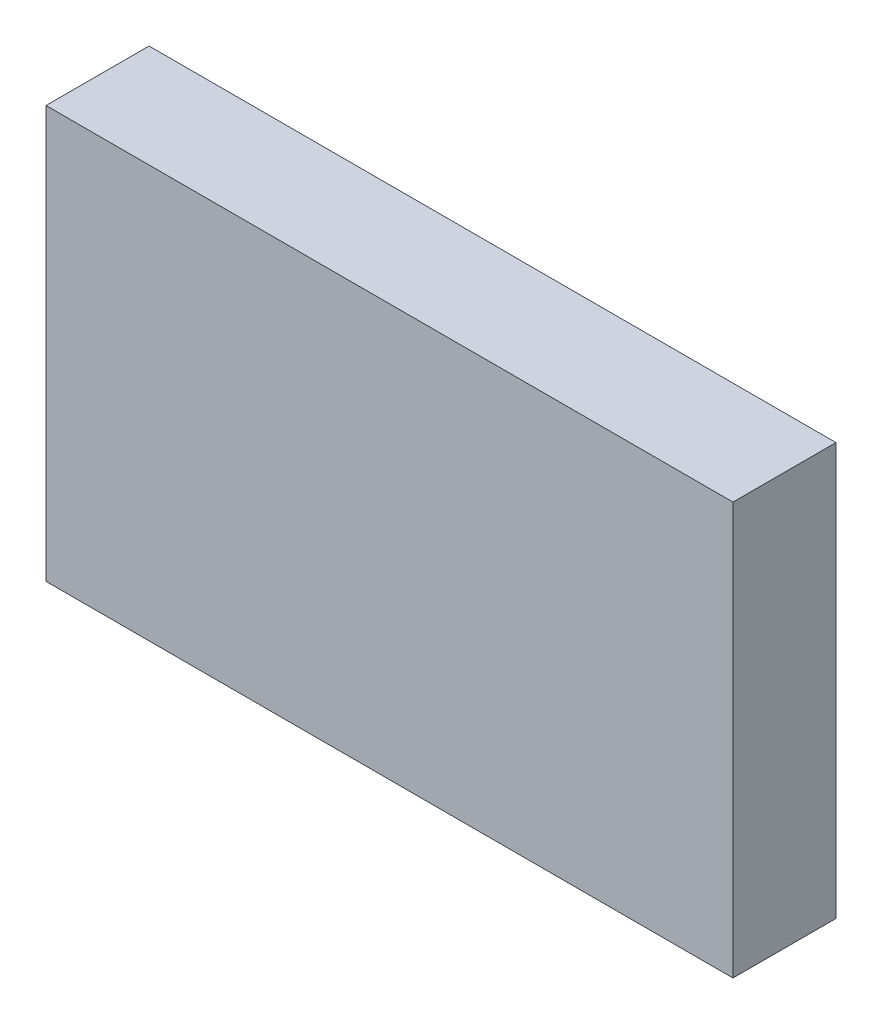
ISO-10303-21;
HEADER;
FILE_DESCRIPTION(('STEP AP214'),'2;1');
FILE_NAME('part.step','',(''),(''),'','','');
FILE_SCHEMA(('AUTOMOTIVE_DESIGN { 1 0 10303 214 1 1 1 1 }'));
ENDSEC;
DATA;
#1=APPLICATION_CONTEXT('core data for automotive mechanical design processes');
#2=APPLICATION_PROTOCOL_DEFINITION('international standard','automotive_design',2000,#1);
#3=PRODUCT_CONTEXT('',#1,'mechanical');
#4=PRODUCT('Part','Part','',(#3));
#5=PRODUCT_RELATED_PRODUCT_CATEGORY('part','',(#4));
#6=PRODUCT_DEFINITION_FORMATION('','',#4);
#7=PRODUCT_DEFINITION_CONTEXT('part definition',#1,'design');
#8=PRODUCT_DEFINITION('design','',#6,#7);
#9=PRODUCT_DEFINITION_SHAPE('','',#8);
#10=(LENGTH_UNIT() NAMED_UNIT(*) SI_UNIT(.MILLI.,.METRE.));
#11=(NAMED_UNIT(*) PLANE_ANGLE_UNIT() SI_UNIT($,.RADIAN.));
#12=(NAMED_UNIT(*) SI_UNIT($,.STERADIAN.) SOLID_ANGLE_UNIT());
#13=UNCERTAINTY_MEASURE_WITH_UNIT(LENGTH_MEASURE(1.E-05),#10,'distance_accuracy_value','');
#14=(GEOMETRIC_REPRESENTATION_CONTEXT(3) GLOBAL_UNCERTAINTY_ASSIGNED_CONTEXT((#13)) GLOBAL_UNIT_ASSIGNED_CONTEXT((#10,
#11,#12)) REPRESENTATION_CONTEXT('',''));
#15=CARTESIAN_POINT('',(0.,0.,0.));
#16=DIRECTION('',(0.,0.,1.));
#17=DIRECTION('',(1.,0.,0.));
#18=AXIS2_PLACEMENT_3D('',#15,#16,#17);
#19=CARTESIAN_POINT('',(0.,0.,15.));
#20=DIRECTION('',(1.,0.,0.));
#21=DIRECTION('',(0.,1.,0.));
#22=AXIS2_PLACEMENT_3D('',#19,#20,#21);
#23=PLANE('',#22);
#24=DIRECTION('',(0.,-1.,0.));
#25=VECTOR('',#24,1.);
#26=CARTESIAN_POINT('',(0.,0.,0.));
#27=LINE('',#26,#25);
#28=CARTESIAN_POINT('',(0.,0.,0.));
#29=VERTEX_POINT('',#28);
#30=CARTESIAN_POINT('',(0.,-60.,0.));
#31=VERTEX_POINT('',#30);
#32=EDGE_CURVE('E73',#29,#31,#27,.T.);
#33=ORIENTED_EDGE('',*,*,#32,.T.);
#34=DIRECTION('',(0.,0.,-1.));
#35=VECTOR('',#34,1.);
#36=CARTESIAN_POINT('',(0.,-60.,15.));
#37=LINE('',#36,#35);
#38=CARTESIAN_POINT('',(0.,-60.,15.));
#39=VERTEX_POINT('',#38);
#40=EDGE_CURVE('E11',#39,#31,#37,.T.);
#41=ORIENTED_EDGE('',*,*,#40,.F.);
#42=DIRECTION('',(0.,-1.,0.));
#43=VECTOR('',#42,1.);
#44=CARTESIAN_POINT('',(0.,0.,15.));
#45=LINE('',#44,#43);
#46=CARTESIAN_POINT('',(0.,0.,15.));
#47=VERTEX_POINT('',#46);
#48=EDGE_CURVE('E91',#47,#39,#45,.T.);
#49=ORIENTED_EDGE('',*,*,#48,.F.);
#50=DIRECTION('',(0.,0.,-1.));
#51=VECTOR('',#50,1.);
#52=CARTESIAN_POINT('',(0.,0.,15.));
#53=LINE('',#52,#51);
#54=EDGE_CURVE('E85',#47,#29,#53,.T.);
#55=ORIENTED_EDGE('',*,*,#54,.T.);
#56=EDGE_LOOP('',(#33,#41,#49,#55));
#57=FACE_BOUND('',#56,.T.);
#58=ADVANCED_FACE('F29',(#57),#23,.F.);
#59=CARTESIAN_POINT('',(0.,-60.,15.));
#60=DIRECTION('',(0.,1.,0.));
#61=DIRECTION('',(0.,0.,1.));
#62=AXIS2_PLACEMENT_3D('',#59,#60,#61);
#63=PLANE('',#62);
#64=DIRECTION('',(1.,0.,0.));
#65=VECTOR('',#64,1.);
#66=CARTESIAN_POINT('',(0.,-60.,0.));
#67=LINE('',#66,#65);
#68=CARTESIAN_POINT('',(100.,-60.,0.));
#69=VERTEX_POINT('',#68);
#70=EDGE_CURVE('E69',#31,#69,#67,.T.);
#71=ORIENTED_EDGE('',*,*,#70,.T.);
#72=DIRECTION('',(0.,0.,-1.));
#73=VECTOR('',#72,1.);
#74=CARTESIAN_POINT('',(100.,-60.,15.));
#75=LINE('',#74,#73);
#76=CARTESIAN_POINT('',(100.,-60.,15.));
#77=VERTEX_POINT('',#76);
#78=EDGE_CURVE('E36',#77,#69,#75,.T.);
#79=ORIENTED_EDGE('',*,*,#78,.F.);
#80=DIRECTION('',(1.,0.,0.));
#81=VECTOR('',#80,1.);
#82=CARTESIAN_POINT('',(0.,-60.,15.));
#83=LINE('',#82,#81);
#84=EDGE_CURVE('E81',#39,#77,#83,.T.);
#85=ORIENTED_EDGE('',*,*,#84,.F.);
#86=ORIENTED_EDGE('',*,*,#40,.T.);
#87=EDGE_LOOP('',(#71,#79,#85,#86));
#88=FACE_BOUND('',#87,.T.);
#89=ADVANCED_FACE('F80',(#88),#63,.F.);
#90=CARTESIAN_POINT('',(100.,0.,15.));
#91=DIRECTION('',(-1.,0.,0.));
#92=DIRECTION('',(0.,0.,1.));
#93=AXIS2_PLACEMENT_3D('',#90,#91,#92);
#94=PLANE('',#93);
#95=DIRECTION('',(0.,1.,0.));
#96=VECTOR('',#95,1.);
#97=CARTESIAN_POINT('',(100.,0.,0.));
#98=LINE('',#97,#96);
#99=CARTESIAN_POINT('',(100.,0.,0.));
#100=VERTEX_POINT('',#99);
#101=EDGE_CURVE('E74',#69,#100,#98,.T.);
#102=ORIENTED_EDGE('',*,*,#101,.T.);
#103=DIRECTION('',(0.,0.,-1.));
#104=VECTOR('',#103,1.);
#105=CARTESIAN_POINT('',(100.,0.,15.));
#106=LINE('',#105,#104);
#107=CARTESIAN_POINT('',(100.,0.,15.));
#108=VERTEX_POINT('',#107);
#109=EDGE_CURVE('E97',#108,#100,#106,.T.);
#110=ORIENTED_EDGE('',*,*,#109,.F.);
#111=DIRECTION('',(0.,1.,0.));
#112=VECTOR('',#111,1.);
#113=CARTESIAN_POINT('',(100.,0.,15.));
#114=LINE('',#113,#112);
#115=EDGE_CURVE('E48',#77,#108,#114,.T.);
#116=ORIENTED_EDGE('',*,*,#115,.F.);
#117=ORIENTED_EDGE('',*,*,#78,.T.);
#118=EDGE_LOOP('',(#102,#110,#116,#117));
#119=FACE_BOUND('',#118,.T.);
#120=ADVANCED_FACE('F100',(#119),#94,.F.);
#121=CARTESIAN_POINT('',(0.,0.,15.));
#122=DIRECTION('',(0.,-1.,0.));
#123=DIRECTION('',(0.,0.,-1.));
#124=AXIS2_PLACEMENT_3D('',#121,#122,#123);
#125=PLANE('',#124);
#126=DIRECTION('',(-1.,0.,0.));
#127=VECTOR('',#126,1.);
#128=CARTESIAN_POINT('',(0.,0.,0.));
#129=LINE('',#128,#127);
#130=EDGE_CURVE('E89',#100,#29,#129,.T.);
#131=ORIENTED_EDGE('',*,*,#130,.T.);
#132=ORIENTED_EDGE('',*,*,#54,.F.);
#133=DIRECTION('',(-1.,0.,0.));
#134=VECTOR('',#133,1.);
#135=CARTESIAN_POINT('',(0.,0.,15.));
#136=LINE('',#135,#134);
#137=EDGE_CURVE('E43',#108,#47,#136,.T.);
#138=ORIENTED_EDGE('',*,*,#137,.F.);
#139=ORIENTED_EDGE('',*,*,#109,.T.);
#140=EDGE_LOOP('',(#131,#132,#138,#139));
#141=FACE_BOUND('',#140,.T.);
#142=ADVANCED_FACE('F102',(#141),#125,.F.);
#143=CARTESIAN_POINT('',(0.,-60.,15.));
#144=DIRECTION('',(0.,0.,1.));
#145=DIRECTION('',(1.,0.,0.));
#146=AXIS2_PLACEMENT_3D('',#143,#144,#145);
#147=PLANE('',#146);
#148=ORIENTED_EDGE('',*,*,#48,.T.);
#149=ORIENTED_EDGE('',*,*,#84,.T.);
#150=ORIENTED_EDGE('',*,*,#115,.T.);
#151=ORIENTED_EDGE('',*,*,#137,.T.);
#152=EDGE_LOOP('',(#148,#149,#150,#151));
#153=FACE_BOUND('',#152,.T.);
#154=ADVANCED_FACE('F103',(#153),#147,.T.);
#155=CARTESIAN_POINT('',(0.,-60.,0.));
#156=DIRECTION('',(0.,0.,1.));
#157=DIRECTION('',(1.,0.,0.));
#158=AXIS2_PLACEMENT_3D('',#155,#156,#157);
#159=PLANE('',#158);
#160=ORIENTED_EDGE('',*,*,#32,.F.);
#161=ORIENTED_EDGE('',*,*,#130,.F.);
#162=ORIENTED_EDGE('',*,*,#101,.F.);
#163=ORIENTED_EDGE('',*,*,#70,.F.);
#164=EDGE_LOOP('',(#160,#161,#162,#163));
#165=FACE_BOUND('',#164,.T.);
#166=ADVANCED_FACE('F70',(#165),#159,.F.);
#167=CLOSED_SHELL('',(#58,#89,#120,#142,#154,#166));
#168=MANIFOLD_SOLID_BREP('B2',#167);
#169=ADVANCED_BREP_SHAPE_REPRESENTATION('',(#18,#168),#14);
#170=SHAPE_DEFINITION_REPRESENTATION(#9,#169);
ENDSEC;
END-ISO-10303-21;
